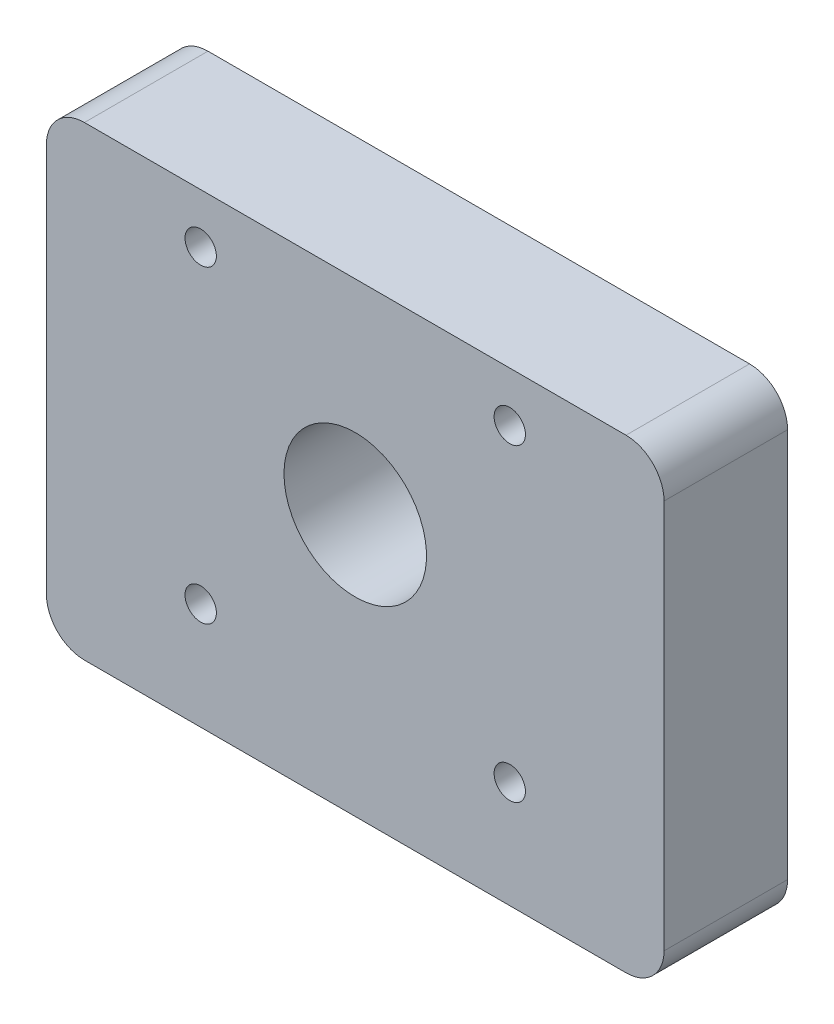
from build123d import *

# Parameters (mm, degrees)
SKETCH_1_W             = 65
SKETCH_1_H             = 49
EXTRUDE_1_DEPTH        = 13
SKETCH_2_R             = 7.5
CUT_EXTRUDE_1_DEPTH    = 37.5
FILLET_1_R             = 4
HOLE_WIZARD_M4_1_D     = 3.3
HOLE_WIZARD_M4_1_DEPTH = 10.1
HOLE_WIZARD_M4_1_TIP   = 0.991420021


with BuildPart() as part:
    # Sketch 1 → Extrude 1 (new body)
    with BuildSketch(Plane.XY):
        with Locations((0, -3)):
            Rectangle(SKETCH_1_W, SKETCH_1_H)
    extrude(amount=EXTRUDE_1_DEPTH)

    # Sketch 2 → Cut-Extrude 1 (cut)
    with BuildSketch(Plane(origin=(0, 0, 0), x_dir=(-1, 0, 0), z_dir=(0, 0, -1))):
        Circle(SKETCH_2_R)
    extrude(amount=-CUT_EXTRUDE_1_DEPTH, mode=Mode.SUBTRACT)

    # Fillet 1
    fillet_1_edges = [part.edges().sort_by_distance(p)[0] for p in [
        (32.5, -27.5, 6.5),
        (-32.5, -27.5, 6.5),
        (-32.5, 21.5, 6.5),
        (32.5, 21.5, 6.5),
    ]]
    fillet(fillet_1_edges, radius=FILLET_1_R)

    # Hole Wizard M4 _1
    with Locations(Plane(origin=(-16.263455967, 16.263455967, 13), x_dir=(1, 0, 0), z_dir=(0, 0, 1))):
        with Locations((0, 0), (32.526911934, 0), (32.526911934, -32.526911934), (0, -32.526911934)):
            Hole(HOLE_WIZARD_M4_1_D / 2, depth=HOLE_WIZARD_M4_1_DEPTH)
            with Locations((0, 0, -(HOLE_WIZARD_M4_1_DEPTH + HOLE_WIZARD_M4_1_TIP / 2))):  # 118° drill point
                Cone(0, HOLE_WIZARD_M4_1_D / 2, HOLE_WIZARD_M4_1_TIP, mode=Mode.SUBTRACT)


solid = part.part
